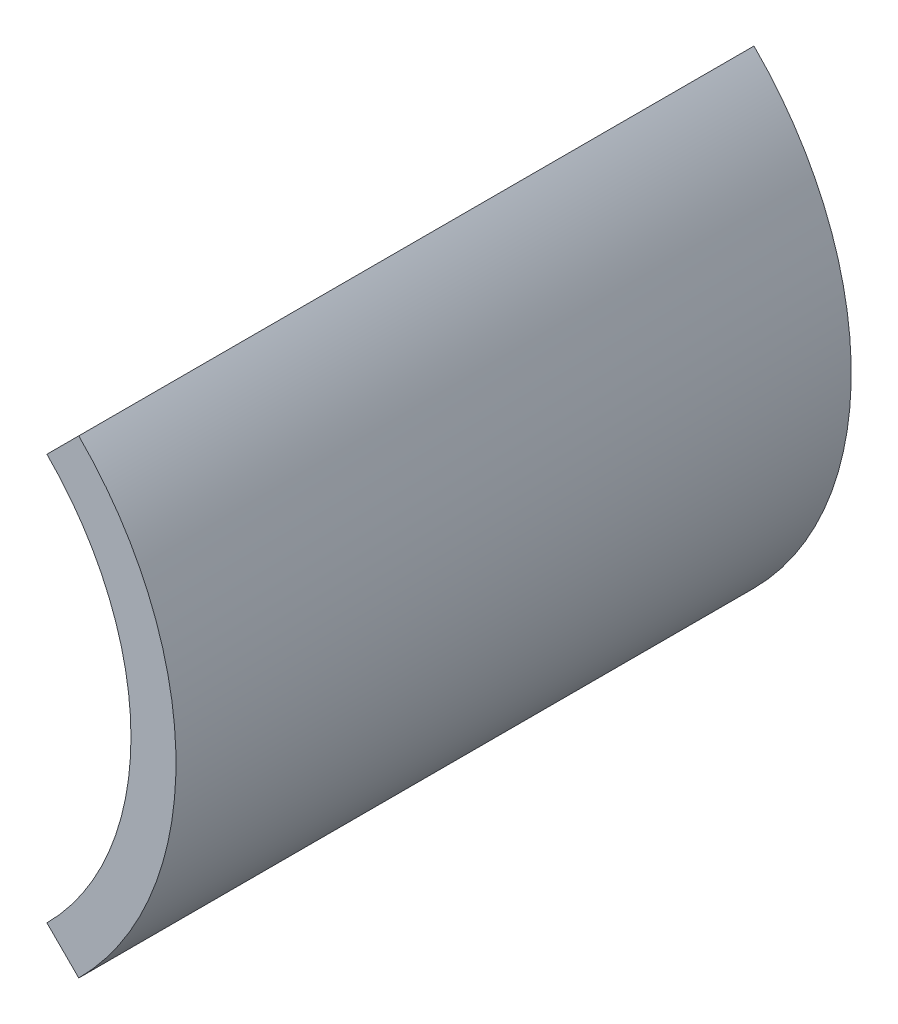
from build123d import *

# Parameters (mm, degrees)
BOSS_EXTRUDE1_DEPTH = 15


with BuildPart() as part:
    # Sketch1 → Boss-Extrude1 (new, symmetric)
    with BuildSketch(Plane.XY):
        with BuildLine():
            Line((9.01561146, 9.01561146), (10.429825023, 10.429825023))
            ThreePointArc((10.429825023, 10.429825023), (14.75, 0), (10.429825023, -10.429825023))
            Line((10.429825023, -10.429825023), (9.01561146, -9.01561146))
            ThreePointArc((9.01561146, -9.01561146), (12.75, 0), (9.01561146, 9.01561146))
        make_face()
    extrude(amount=BOSS_EXTRUDE1_DEPTH, both=True)


solid = part.part
